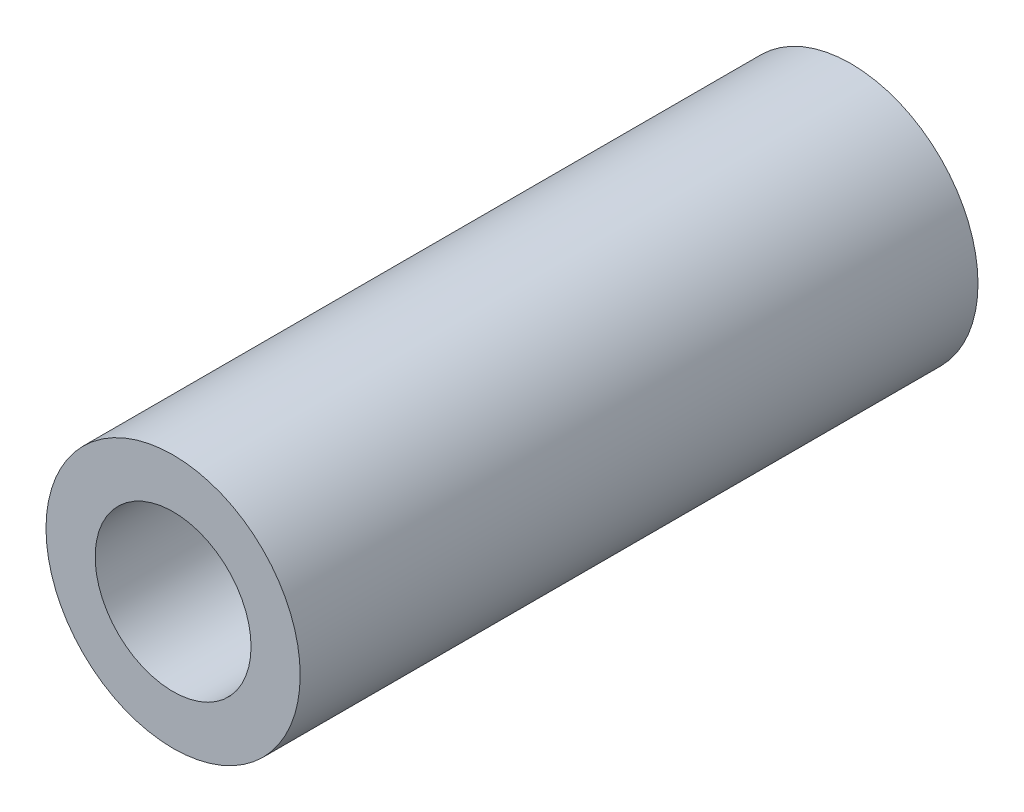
from build123d import *

# Parameters (mm, degrees)
EXTRUDE1_DEPTH      = 6.35
EXTRUDE1_DEPTH_BACK = 6.35
SKETCH1_R           = 2.38125
SKETCH1_R_2         = 1.4605


with BuildPart() as part:
    # Sketch1 → Extrude1 (new, two sides: drawn at the far end of the back side and taken through both)
    with BuildSketch(Plane.XY.offset(-EXTRUDE1_DEPTH_BACK)):
        Circle(SKETCH1_R)
        Circle(SKETCH1_R_2, mode=Mode.SUBTRACT)
    extrude(amount=EXTRUDE1_DEPTH + EXTRUDE1_DEPTH_BACK)


solid = part.part
